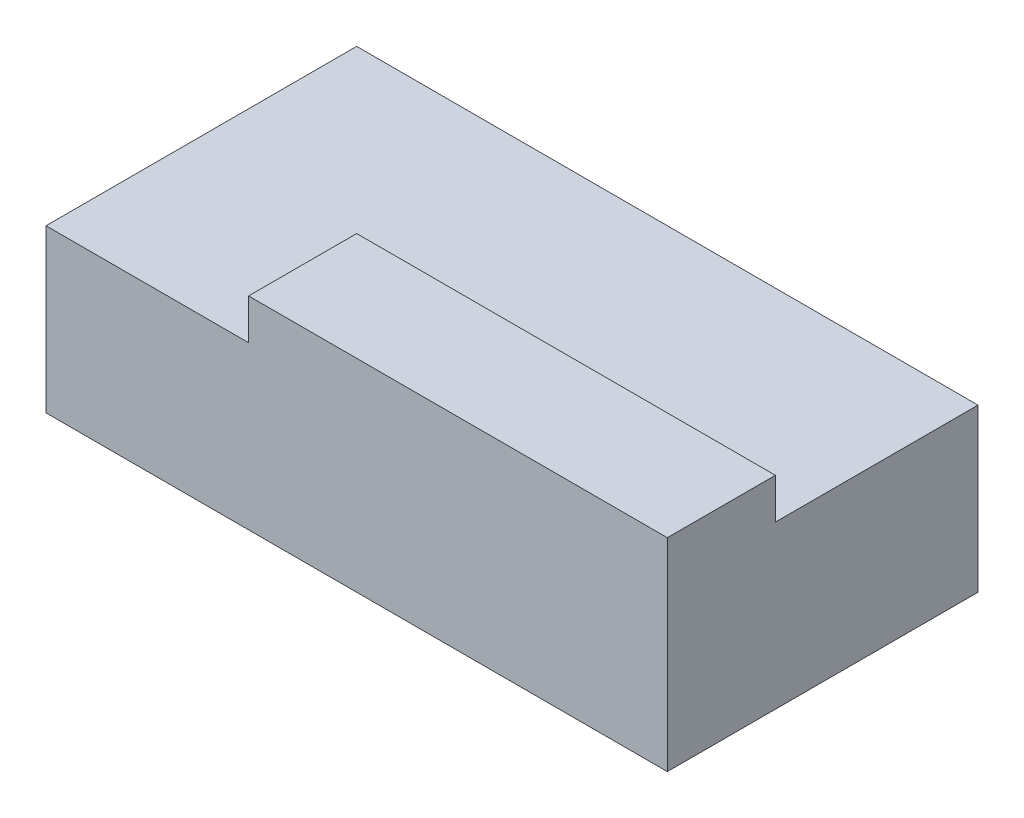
from build123d import *

# Parameters (mm, degrees)
SKETCH1_W           = 230
SKETCH1_H           = 115
BOSS_EXTRUDE1_DEPTH = 37.5
SKETCH2_W           = 75
SKETCH2_H           = 115
CUT_EXTRUDE1_DEPTH  = 15
SKETCH4_W           = 155
SKETCH4_H           = 75
CUT_EXTRUDE3_DEPTH  = 15


with BuildPart() as part:
    # Sketch1 → Boss-Extrude1 (new, symmetric)
    with BuildSketch(Plane(origin=(0, 0, 0), x_dir=(1, 0, 0), z_dir=(0, 1, 0))):
        Rectangle(SKETCH1_W, SKETCH1_H)
    extrude(amount=BOSS_EXTRUDE1_DEPTH, both=True)

    # Sketch2 → Cut-Extrude1 (cut)
    with BuildSketch(Plane(origin=(0, 37.5, 0), x_dir=(1, 0, 0), z_dir=(0, 1, 0))):
        with Locations((-77.5, 0)):
            Rectangle(SKETCH2_W, SKETCH2_H)
    extrude(amount=-CUT_EXTRUDE1_DEPTH, mode=Mode.SUBTRACT)

    # Sketch4 → Cut-Extrude3 (cut)
    with BuildSketch(Plane(origin=(0, 37.5, 0), x_dir=(1, 0, 0), z_dir=(0, 1, 0))):
        with Locations((37.5, 20)):
            Rectangle(SKETCH4_W, SKETCH4_H)
    extrude(amount=-CUT_EXTRUDE3_DEPTH, mode=Mode.SUBTRACT)


solid = part.part
